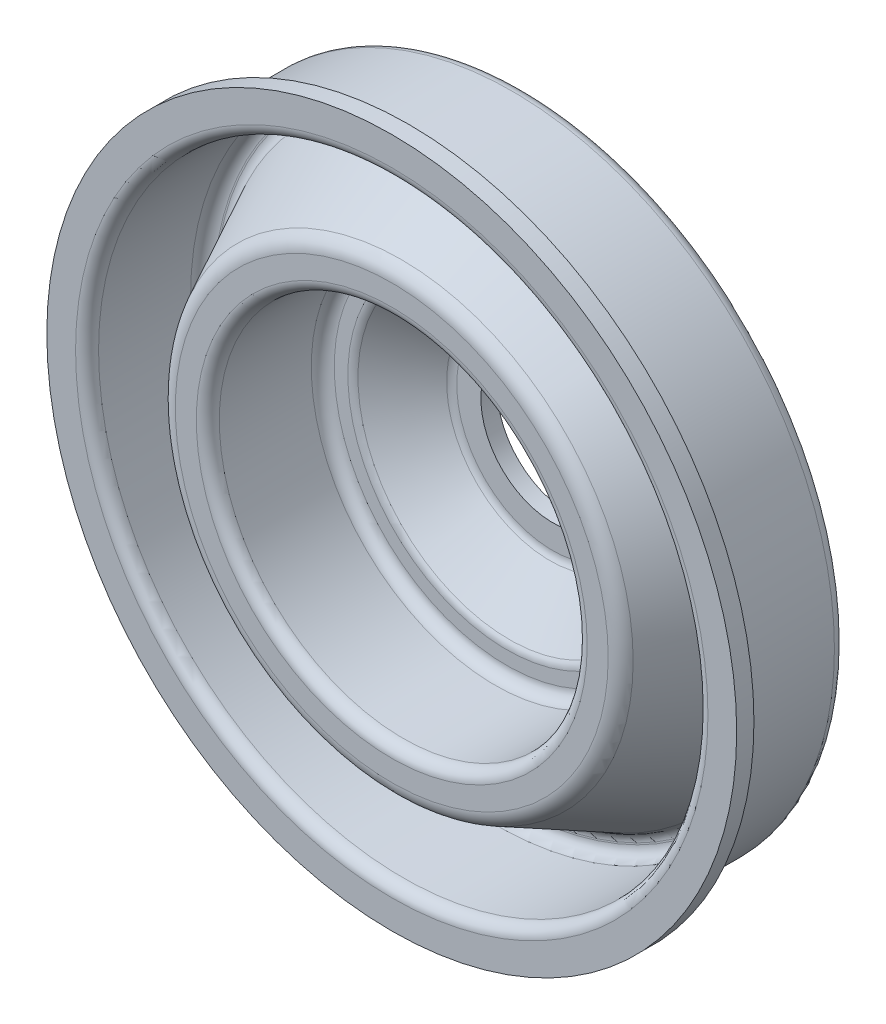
from build123d import *


with BuildPart() as part:
    # Esquisse1 → R_volution2 (revolve)
    with BuildSketch(Plane(origin=(0, 0, 0), x_dir=(0, 0, -1), z_dir=(1, 0, 0)), mode=Mode.PRIVATE) as r_volution2_sk:
        with BuildLine():
            Line((-5.18268262, 13.172402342), (-1.654727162, 8.995242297))
            ThreePointArc((-1.654727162, 8.995242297), (-1.479562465, 8.693527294), (-1.418705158, 8.35))
            Line((-1.418705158, 8.35), (-1.418705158, 6.25))
            Line((-1.418705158, 6.25), (0, 6.25))
            Line((0, 6.25), (0, 8.9))
            ThreePointArc((0, 8.9), (-0.060857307, 9.243527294), (-0.236022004, 9.545242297))
            Line((-0.236022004, 9.545242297), (-3.68268262, 13.626147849))
            ThreePointArc((-3.68268262, 13.626147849), (-3.857847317, 13.927862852), (-3.918704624, 14.271390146))
            Line((-3.918704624, 14.271390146), (-3.918704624, 15.501652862))
            ThreePointArc((-3.918704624, 15.501652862), (-4.476035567, 16.886826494), (-5.837410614, 17.5))
            Line((-5.837410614, 17.5), (-12.328535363, 17.5))
            ThreePointArc((-12.328535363, 17.5), (-13.301784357, 18.270247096), (-12.775748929, 19.394427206))
            Line((-12.775748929, 19.394427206), (-4.747884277, 23.408359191))
            ThreePointArc((-4.747884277, 23.408359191), (-4.142728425, 23.96140331), (-3.918704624, 24.75))
            Line((-3.918704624, 24.75), (-3.918704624, 27))
            ThreePointArc((-3.918704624, 27), (-4.211597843, 27.707106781), (-4.918704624, 28))
            Line((-4.918704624, 28), (-13.918704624, 28))
            Line((-13.918704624, 28), (-13.918704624, 30))
            Line((-13.918704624, 30), (-15.418704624, 30))
            Line((-15.418704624, 30), (-15.418704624, 27.5))
            ThreePointArc((-15.418704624, 27.5), (-15.125811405, 26.792893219), (-14.418704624, 26.5))
            Line((-14.418704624, 26.5), (-6.418704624, 26.5))
            ThreePointArc((-6.418704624, 26.5), (-5.711597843, 26.207106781), (-5.418704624, 25.5))
            Line((-5.418704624, 25.5), (-5.418704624, 25.370084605))
            ThreePointArc((-5.418704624, 25.370084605), (-5.568053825, 24.844353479), (-5.971491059, 24.475657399))
            Line((-5.971491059, 24.475657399), (-14.589524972, 20.166640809))
            ThreePointArc((-14.589524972, 20.166640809), (-15.194680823, 19.61359669), (-15.418704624, 18.825))
            Line((-15.418704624, 18.825), (-15.418704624, 17))
            ThreePointArc((-15.418704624, 17), (-15.125811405, 16.292893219), (-14.418704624, 16))
            Line((-14.418704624, 16), (-6.418704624, 16))
            ThreePointArc((-6.418704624, 16), (-5.711597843, 15.707106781), (-5.418704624, 15))
            Line((-5.418704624, 15), (-5.418704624, 13.817644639))
            ThreePointArc((-5.418704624, 13.817644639), (-5.357847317, 13.474117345), (-5.18268262, 13.172402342))
        make_face()
    revolve(r_volution2_sk.sketch.rotate(Axis((0, 0, 1.418705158), (0, 0, -1)), 90), axis=Axis((0, 0, 1.418705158), (0, 0, -1)))


solid = part.part
